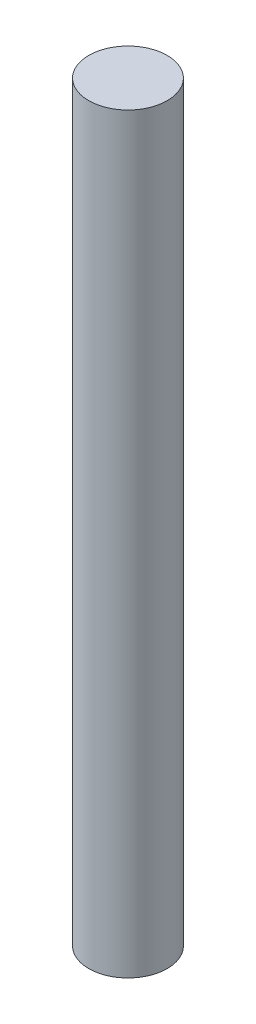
from build123d import *

# Parameters (mm, degrees)
SKETCH1_R           = 2.609499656
BOSS_EXTRUDE1_DEPTH = 50


with BuildPart() as part:
    # Sketch1 → Boss-Extrude1 (new body)
    with BuildSketch(Plane(origin=(0, 0, 0), x_dir=(1, 0, 0), z_dir=(0, 1, 0))):
        with Locations(Location((0, 0, 0), (0, 0, 270))):
            Circle(SKETCH1_R)
    extrude(amount=BOSS_EXTRUDE1_DEPTH)


solid = part.part
